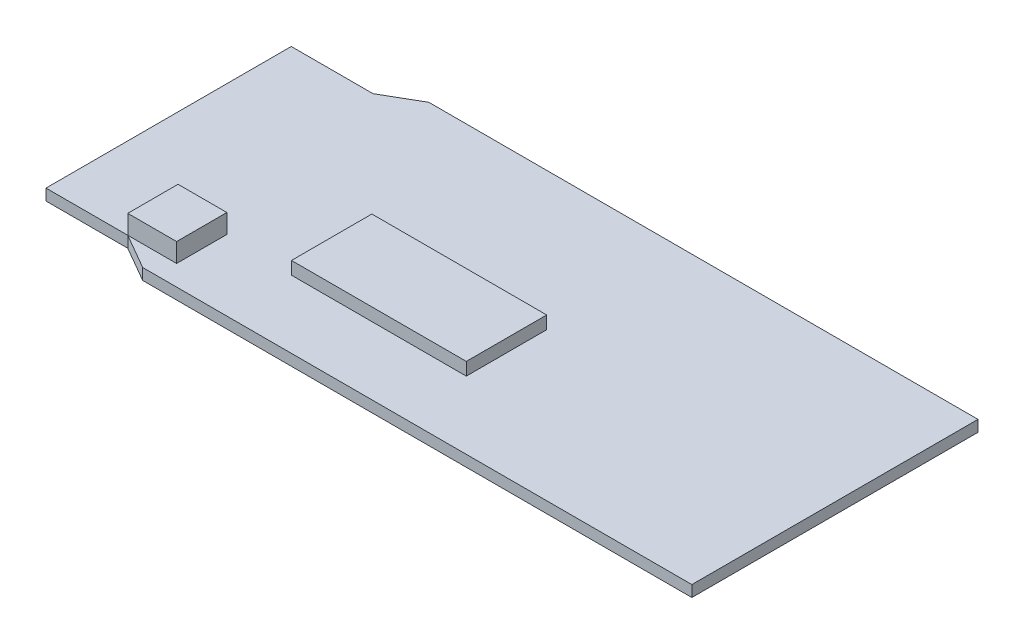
ISO-10303-21;
HEADER;
FILE_DESCRIPTION(('STEP AP214'),'2;1');
FILE_NAME('part.step','',(''),(''),'','','');
FILE_SCHEMA(('AUTOMOTIVE_DESIGN { 1 0 10303 214 1 1 1 1 }'));
ENDSEC;
DATA;
#1=APPLICATION_CONTEXT('core data for automotive mechanical design processes');
#2=APPLICATION_PROTOCOL_DEFINITION('international standard','automotive_design',2000,#1);
#3=PRODUCT_CONTEXT('',#1,'mechanical');
#4=PRODUCT('Part','Part','',(#3));
#5=PRODUCT_RELATED_PRODUCT_CATEGORY('part','',(#4));
#6=PRODUCT_DEFINITION_FORMATION('','',#4);
#7=PRODUCT_DEFINITION_CONTEXT('part definition',#1,'design');
#8=PRODUCT_DEFINITION('design','',#6,#7);
#9=PRODUCT_DEFINITION_SHAPE('','',#8);
#10=(LENGTH_UNIT() NAMED_UNIT(*) SI_UNIT(.MILLI.,.METRE.));
#11=(NAMED_UNIT(*) PLANE_ANGLE_UNIT() SI_UNIT($,.RADIAN.));
#12=(NAMED_UNIT(*) SI_UNIT($,.STERADIAN.) SOLID_ANGLE_UNIT());
#13=UNCERTAINTY_MEASURE_WITH_UNIT(LENGTH_MEASURE(1.E-05),#10,'distance_accuracy_value','');
#14=(GEOMETRIC_REPRESENTATION_CONTEXT(3) GLOBAL_UNCERTAINTY_ASSIGNED_CONTEXT((#13)) GLOBAL_UNIT_ASSIGNED_CONTEXT((#10,
#11,#12)) REPRESENTATION_CONTEXT('',''));
#15=CARTESIAN_POINT('',(0.,0.,0.));
#16=DIRECTION('',(0.,0.,1.));
#17=DIRECTION('',(1.,0.,0.));
#18=AXIS2_PLACEMENT_3D('',#15,#16,#17);
#19=CARTESIAN_POINT('',(-16.2364543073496,1.397,-17.78));
#20=DIRECTION('',(0.,-1.,0.));
#21=DIRECTION('',(0.,0.,-1.));
#22=AXIS2_PLACEMENT_3D('',#19,#20,#21);
#23=PLANE('',#22);
#24=DIRECTION('',(0.,0.,1.));
#25=VECTOR('',#24,1.);
#26=CARTESIAN_POINT('',(10.16,1.397,-2.54));
#27=LINE('',#26,#25);
#28=CARTESIAN_POINT('',(10.16,1.397,-8.7884));
#29=VERTEX_POINT('',#28);
#30=CARTESIAN_POINT('',(10.16,1.397,-2.54));
#31=VERTEX_POINT('',#30);
#32=EDGE_CURVE('E161',#29,#31,#27,.T.);
#33=ORIENTED_EDGE('',*,*,#32,.F.);
#34=DIRECTION('',(-1.,0.,0.));
#35=VECTOR('',#34,1.);
#36=CARTESIAN_POINT('',(10.16,1.397,-8.7884));
#37=LINE('',#36,#35);
#38=CARTESIAN_POINT('',(16.2306,1.397,-8.7884));
#39=VERTEX_POINT('',#38);
#40=EDGE_CURVE('E174',#39,#29,#37,.T.);
#41=ORIENTED_EDGE('',*,*,#40,.F.);
#42=DIRECTION('',(0.,0.,-1.));
#43=VECTOR('',#42,1.);
#44=CARTESIAN_POINT('',(16.2306,1.397,-2.54));
#45=LINE('',#44,#43);
#46=CARTESIAN_POINT('',(16.2306,1.397,-2.54));
#47=VERTEX_POINT('',#46);
#48=EDGE_CURVE('E183',#47,#39,#45,.T.);
#49=ORIENTED_EDGE('',*,*,#48,.F.);
#50=DIRECTION('',(1.,0.,0.));
#51=VECTOR('',#50,1.);
#52=CARTESIAN_POINT('',(10.16,1.397,-2.54));
#53=LINE('',#52,#51);
#54=EDGE_CURVE('E164',#31,#47,#53,.T.);
#55=ORIENTED_EDGE('',*,*,#54,.F.);
#56=DIRECTION('',(0.866025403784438,0.,0.500000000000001));
#57=VECTOR('',#56,1.);
#58=CARTESIAN_POINT('',(10.16,1.397,-2.54));
#59=LINE('',#58,#57);
#60=CARTESIAN_POINT('',(14.5594090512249,1.397,0.));
#61=VERTEX_POINT('',#60);
#62=EDGE_CURVE('E226',#31,#61,#59,.T.);
#63=ORIENTED_EDGE('',*,*,#62,.T.);
#64=DIRECTION('',(1.,0.,0.));
#65=VECTOR('',#64,1.);
#66=CARTESIAN_POINT('',(14.5594090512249,1.397,0.));
#67=LINE('',#66,#65);
#68=CARTESIAN_POINT('',(82.804,1.397,0.));
#69=VERTEX_POINT('',#68);
#70=EDGE_CURVE('E228',#61,#69,#67,.T.);
#71=ORIENTED_EDGE('',*,*,#70,.T.);
#72=DIRECTION('',(0.,0.,-1.));
#73=VECTOR('',#72,1.);
#74=CARTESIAN_POINT('',(82.804,1.397,0.));
#75=LINE('',#74,#73);
#76=CARTESIAN_POINT('',(82.804,1.397,-35.56));
#77=VERTEX_POINT('',#76);
#78=EDGE_CURVE('E230',#69,#77,#75,.T.);
#79=ORIENTED_EDGE('',*,*,#78,.T.);
#80=DIRECTION('',(-1.,0.,0.));
#81=VECTOR('',#80,1.);
#82=CARTESIAN_POINT('',(14.5594090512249,1.397,-35.56));
#83=LINE('',#82,#81);
#84=CARTESIAN_POINT('',(14.5594090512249,1.397,-35.56));
#85=VERTEX_POINT('',#84);
#86=EDGE_CURVE('E232',#77,#85,#83,.T.);
#87=ORIENTED_EDGE('',*,*,#86,.T.);
#88=DIRECTION('',(-0.866025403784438,0.,0.500000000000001));
#89=VECTOR('',#88,1.);
#90=CARTESIAN_POINT('',(10.16,1.397,-33.02));
#91=LINE('',#90,#89);
#92=CARTESIAN_POINT('',(10.16,1.397,-33.02));
#93=VERTEX_POINT('',#92);
#94=EDGE_CURVE('E216',#85,#93,#91,.T.);
#95=ORIENTED_EDGE('',*,*,#94,.T.);
#96=DIRECTION('',(-1.,0.,0.));
#97=VECTOR('',#96,1.);
#98=CARTESIAN_POINT('',(10.16,1.397,-33.02));
#99=LINE('',#98,#97);
#100=CARTESIAN_POINT('',(0.,1.397,-33.02));
#101=VERTEX_POINT('',#100);
#102=EDGE_CURVE('E219',#93,#101,#99,.T.);
#103=ORIENTED_EDGE('',*,*,#102,.T.);
#104=DIRECTION('',(0.,0.,1.));
#105=VECTOR('',#104,1.);
#106=CARTESIAN_POINT('',(0.,1.397,-2.54));
#107=LINE('',#106,#105);
#108=CARTESIAN_POINT('',(0.,1.397,-2.54));
#109=VERTEX_POINT('',#108);
#110=EDGE_CURVE('E221',#101,#109,#107,.T.);
#111=ORIENTED_EDGE('',*,*,#110,.T.);
#112=DIRECTION('',(1.,0.,0.));
#113=VECTOR('',#112,1.);
#114=CARTESIAN_POINT('',(10.16,1.397,-2.54));
#115=LINE('',#114,#113);
#116=EDGE_CURVE('E223',#109,#31,#115,.T.);
#117=ORIENTED_EDGE('',*,*,#116,.T.);
#118=EDGE_LOOP('',(#33,#41,#49,#55,#63,#71,#79,#87,#95,#103,#111,#117));
#119=FACE_BOUND('',#118,.T.);
#120=DIRECTION('',(0.,0.,1.));
#121=VECTOR('',#120,1.);
#122=CARTESIAN_POINT('',(24.6286693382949,1.397,-18.4085686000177));
#123=LINE('',#122,#121);
#124=CARTESIAN_POINT('',(24.6286693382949,1.397,-18.4085686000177));
#125=VERTEX_POINT('',#124);
#126=CARTESIAN_POINT('',(24.6286693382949,1.397,-8.41579483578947));
#127=VERTEX_POINT('',#126);
#128=EDGE_CURVE('E160',#125,#127,#123,.T.);
#129=ORIENTED_EDGE('',*,*,#128,.F.);
#130=DIRECTION('',(-1.,0.,0.));
#131=VECTOR('',#130,1.);
#132=CARTESIAN_POINT('',(24.6286693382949,1.397,-18.4085686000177));
#133=LINE('',#132,#131);
#134=CARTESIAN_POINT('',(46.3557815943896,1.397,-18.4085686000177));
#135=VERTEX_POINT('',#134);
#136=EDGE_CURVE('E157',#135,#125,#133,.T.);
#137=ORIENTED_EDGE('',*,*,#136,.F.);
#138=DIRECTION('',(0.,0.,-1.));
#139=VECTOR('',#138,1.);
#140=CARTESIAN_POINT('',(46.3557815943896,1.397,-18.4085686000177));
#141=LINE('',#140,#139);
#142=CARTESIAN_POINT('',(46.3557815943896,1.397,-8.41579483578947));
#143=VERTEX_POINT('',#142);
#144=EDGE_CURVE('E50',#143,#135,#141,.T.);
#145=ORIENTED_EDGE('',*,*,#144,.F.);
#146=DIRECTION('',(1.,0.,0.));
#147=VECTOR('',#146,1.);
#148=CARTESIAN_POINT('',(24.6286693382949,1.397,-8.41579483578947));
#149=LINE('',#148,#147);
#150=EDGE_CURVE('E45',#127,#143,#149,.T.);
#151=ORIENTED_EDGE('',*,*,#150,.F.);
#152=EDGE_LOOP('',(#129,#137,#145,#151));
#153=FACE_BOUND('',#152,.T.);
#154=ADVANCED_FACE('F30',(#119,#153),#23,.F.);
#155=CARTESIAN_POINT('',(10.16,1.397,-33.02));
#156=DIRECTION('',(0.500000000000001,0.,0.866025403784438));
#157=DIRECTION('',(0.866025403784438,0.,-0.500000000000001));
#158=AXIS2_PLACEMENT_3D('',#155,#156,#157);
#159=PLANE('',#158);
#160=DIRECTION('',(-0.866025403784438,0.,0.500000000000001));
#161=VECTOR('',#160,1.);
#162=CARTESIAN_POINT('',(10.16,0.,-33.02));
#163=LINE('',#162,#161);
#164=CARTESIAN_POINT('',(14.5594090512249,0.,-35.56));
#165=VERTEX_POINT('',#164);
#166=CARTESIAN_POINT('',(10.16,0.,-33.02));
#167=VERTEX_POINT('',#166);
#168=EDGE_CURVE('E199',#165,#167,#163,.T.);
#169=ORIENTED_EDGE('',*,*,#168,.T.);
#170=DIRECTION('',(0.,-1.,0.));
#171=VECTOR('',#170,1.);
#172=CARTESIAN_POINT('',(10.16,1.397,-33.02));
#173=LINE('',#172,#171);
#174=EDGE_CURVE('E11',#93,#167,#173,.T.);
#175=ORIENTED_EDGE('',*,*,#174,.F.);
#176=ORIENTED_EDGE('',*,*,#94,.F.);
#177=DIRECTION('',(0.,-1.,0.));
#178=VECTOR('',#177,1.);
#179=CARTESIAN_POINT('',(14.5594090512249,1.397,-35.56));
#180=LINE('',#179,#178);
#181=EDGE_CURVE('E234',#85,#165,#180,.T.);
#182=ORIENTED_EDGE('',*,*,#181,.T.);
#183=EDGE_LOOP('',(#169,#175,#176,#182));
#184=FACE_BOUND('',#183,.T.);
#185=ADVANCED_FACE('F32',(#184),#159,.F.);
#186=CARTESIAN_POINT('',(10.16,1.397,-33.02));
#187=DIRECTION('',(0.,0.,1.));
#188=DIRECTION('',(1.,0.,0.));
#189=AXIS2_PLACEMENT_3D('',#186,#187,#188);
#190=PLANE('',#189);
#191=DIRECTION('',(-1.,0.,0.));
#192=VECTOR('',#191,1.);
#193=CARTESIAN_POINT('',(10.16,0.,-33.02));
#194=LINE('',#193,#192);
#195=CARTESIAN_POINT('',(0.,0.,-33.02));
#196=VERTEX_POINT('',#195);
#197=EDGE_CURVE('E202',#167,#196,#194,.T.);
#198=ORIENTED_EDGE('',*,*,#197,.T.);
#199=DIRECTION('',(0.,-1.,0.));
#200=VECTOR('',#199,1.);
#201=CARTESIAN_POINT('',(0.,1.397,-33.02));
#202=LINE('',#201,#200);
#203=EDGE_CURVE('E38',#101,#196,#202,.T.);
#204=ORIENTED_EDGE('',*,*,#203,.F.);
#205=ORIENTED_EDGE('',*,*,#102,.F.);
#206=ORIENTED_EDGE('',*,*,#174,.T.);
#207=EDGE_LOOP('',(#198,#204,#205,#206));
#208=FACE_BOUND('',#207,.T.);
#209=ADVANCED_FACE('F305',(#208),#190,.F.);
#210=CARTESIAN_POINT('',(0.,1.397,-2.54));
#211=DIRECTION('',(1.,0.,0.));
#212=DIRECTION('',(0.,0.,-1.));
#213=AXIS2_PLACEMENT_3D('',#210,#211,#212);
#214=PLANE('',#213);
#215=DIRECTION('',(0.,0.,1.));
#216=VECTOR('',#215,1.);
#217=CARTESIAN_POINT('',(0.,0.,-2.54));
#218=LINE('',#217,#216);
#219=CARTESIAN_POINT('',(0.,0.,-2.54));
#220=VERTEX_POINT('',#219);
#221=EDGE_CURVE('E204',#196,#220,#218,.T.);
#222=ORIENTED_EDGE('',*,*,#221,.T.);
#223=DIRECTION('',(0.,-1.,0.));
#224=VECTOR('',#223,1.);
#225=CARTESIAN_POINT('',(0.,1.397,-2.54));
#226=LINE('',#225,#224);
#227=EDGE_CURVE('E249',#109,#220,#226,.T.);
#228=ORIENTED_EDGE('',*,*,#227,.F.);
#229=ORIENTED_EDGE('',*,*,#110,.F.);
#230=ORIENTED_EDGE('',*,*,#203,.T.);
#231=EDGE_LOOP('',(#222,#228,#229,#230));
#232=FACE_BOUND('',#231,.T.);
#233=ADVANCED_FACE('F256',(#232),#214,.F.);
#234=CARTESIAN_POINT('',(10.16,1.397,-2.54));
#235=DIRECTION('',(0.,0.,-1.));
#236=DIRECTION('',(-1.,0.,0.));
#237=AXIS2_PLACEMENT_3D('',#234,#235,#236);
#238=PLANE('',#237);
#239=DIRECTION('',(1.,0.,0.));
#240=VECTOR('',#239,1.);
#241=CARTESIAN_POINT('',(10.16,0.,-2.54));
#242=LINE('',#241,#240);
#243=CARTESIAN_POINT('',(10.16,0.,-2.54));
#244=VERTEX_POINT('',#243);
#245=EDGE_CURVE('E206',#220,#244,#242,.T.);
#246=ORIENTED_EDGE('',*,*,#245,.T.);
#247=DIRECTION('',(0.,-1.,0.));
#248=VECTOR('',#247,1.);
#249=CARTESIAN_POINT('',(10.16,1.397,-2.54));
#250=LINE('',#249,#248);
#251=EDGE_CURVE('E246',#31,#244,#250,.T.);
#252=ORIENTED_EDGE('',*,*,#251,.F.);
#253=ORIENTED_EDGE('',*,*,#116,.F.);
#254=ORIENTED_EDGE('',*,*,#227,.T.);
#255=EDGE_LOOP('',(#246,#252,#253,#254));
#256=FACE_BOUND('',#255,.T.);
#257=ADVANCED_FACE('F267',(#256),#238,.F.);
#258=CARTESIAN_POINT('',(10.16,1.397,-2.54));
#259=DIRECTION('',(0.500000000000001,0.,-0.866025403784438));
#260=DIRECTION('',(-0.866025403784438,0.,-0.500000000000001));
#261=AXIS2_PLACEMENT_3D('',#258,#259,#260);
#262=PLANE('',#261);
#263=DIRECTION('',(0.866025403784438,0.,0.500000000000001));
#264=VECTOR('',#263,1.);
#265=CARTESIAN_POINT('',(10.16,0.,-2.54));
#266=LINE('',#265,#264);
#267=CARTESIAN_POINT('',(14.5594090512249,0.,0.));
#268=VERTEX_POINT('',#267);
#269=EDGE_CURVE('E208',#244,#268,#266,.T.);
#270=ORIENTED_EDGE('',*,*,#269,.T.);
#271=DIRECTION('',(0.,-1.,0.));
#272=VECTOR('',#271,1.);
#273=CARTESIAN_POINT('',(14.5594090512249,1.397,0.));
#274=LINE('',#273,#272);
#275=EDGE_CURVE('E243',#61,#268,#274,.T.);
#276=ORIENTED_EDGE('',*,*,#275,.F.);
#277=ORIENTED_EDGE('',*,*,#62,.F.);
#278=ORIENTED_EDGE('',*,*,#251,.T.);
#279=EDGE_LOOP('',(#270,#276,#277,#278));
#280=FACE_BOUND('',#279,.T.);
#281=ADVANCED_FACE('F271',(#280),#262,.F.);
#282=CARTESIAN_POINT('',(14.5594090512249,1.397,0.));
#283=DIRECTION('',(0.,0.,-1.));
#284=DIRECTION('',(-1.,0.,0.));
#285=AXIS2_PLACEMENT_3D('',#282,#283,#284);
#286=PLANE('',#285);
#287=DIRECTION('',(1.,0.,0.));
#288=VECTOR('',#287,1.);
#289=CARTESIAN_POINT('',(14.5594090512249,0.,0.));
#290=LINE('',#289,#288);
#291=CARTESIAN_POINT('',(82.804,0.,0.));
#292=VERTEX_POINT('',#291);
#293=EDGE_CURVE('E210',#268,#292,#290,.T.);
#294=ORIENTED_EDGE('',*,*,#293,.T.);
#295=DIRECTION('',(0.,-1.,0.));
#296=VECTOR('',#295,1.);
#297=CARTESIAN_POINT('',(82.804,1.397,0.));
#298=LINE('',#297,#296);
#299=EDGE_CURVE('E240',#69,#292,#298,.T.);
#300=ORIENTED_EDGE('',*,*,#299,.F.);
#301=ORIENTED_EDGE('',*,*,#70,.F.);
#302=ORIENTED_EDGE('',*,*,#275,.T.);
#303=EDGE_LOOP('',(#294,#300,#301,#302));
#304=FACE_BOUND('',#303,.T.);
#305=ADVANCED_FACE('F317',(#304),#286,.F.);
#306=CARTESIAN_POINT('',(82.804,1.397,0.));
#307=DIRECTION('',(-1.,0.,0.));
#308=DIRECTION('',(0.,0.,1.));
#309=AXIS2_PLACEMENT_3D('',#306,#307,#308);
#310=PLANE('',#309);
#311=DIRECTION('',(0.,0.,-1.));
#312=VECTOR('',#311,1.);
#313=CARTESIAN_POINT('',(82.804,0.,0.));
#314=LINE('',#313,#312);
#315=CARTESIAN_POINT('',(82.804,0.,-35.56));
#316=VERTEX_POINT('',#315);
#317=EDGE_CURVE('E212',#292,#316,#314,.T.);
#318=ORIENTED_EDGE('',*,*,#317,.T.);
#319=DIRECTION('',(0.,-1.,0.));
#320=VECTOR('',#319,1.);
#321=CARTESIAN_POINT('',(82.804,1.397,-35.56));
#322=LINE('',#321,#320);
#323=EDGE_CURVE('E237',#77,#316,#322,.T.);
#324=ORIENTED_EDGE('',*,*,#323,.F.);
#325=ORIENTED_EDGE('',*,*,#78,.F.);
#326=ORIENTED_EDGE('',*,*,#299,.T.);
#327=EDGE_LOOP('',(#318,#324,#325,#326));
#328=FACE_BOUND('',#327,.T.);
#329=ADVANCED_FACE('F313',(#328),#310,.F.);
#330=CARTESIAN_POINT('',(14.5594090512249,1.397,-35.56));
#331=DIRECTION('',(0.,0.,1.));
#332=DIRECTION('',(1.,0.,0.));
#333=AXIS2_PLACEMENT_3D('',#330,#331,#332);
#334=PLANE('',#333);
#335=DIRECTION('',(-1.,0.,0.));
#336=VECTOR('',#335,1.);
#337=CARTESIAN_POINT('',(14.5594090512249,0.,-35.56));
#338=LINE('',#337,#336);
#339=EDGE_CURVE('E214',#316,#165,#338,.T.);
#340=ORIENTED_EDGE('',*,*,#339,.T.);
#341=ORIENTED_EDGE('',*,*,#181,.F.);
#342=ORIENTED_EDGE('',*,*,#86,.F.);
#343=ORIENTED_EDGE('',*,*,#323,.T.);
#344=EDGE_LOOP('',(#340,#341,#342,#343));
#345=FACE_BOUND('',#344,.T.);
#346=ADVANCED_FACE('F310',(#345),#334,.F.);
#347=CARTESIAN_POINT('',(-16.2364543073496,0.,-17.78));
#348=DIRECTION('',(0.,-1.,0.));
#349=DIRECTION('',(0.,0.,-1.));
#350=AXIS2_PLACEMENT_3D('',#347,#348,#349);
#351=PLANE('',#350);
#352=ORIENTED_EDGE('',*,*,#168,.F.);
#353=ORIENTED_EDGE('',*,*,#339,.F.);
#354=ORIENTED_EDGE('',*,*,#317,.F.);
#355=ORIENTED_EDGE('',*,*,#293,.F.);
#356=ORIENTED_EDGE('',*,*,#269,.F.);
#357=ORIENTED_EDGE('',*,*,#245,.F.);
#358=ORIENTED_EDGE('',*,*,#221,.F.);
#359=ORIENTED_EDGE('',*,*,#197,.F.);
#360=EDGE_LOOP('',(#352,#353,#354,#355,#356,#357,#358,#359));
#361=FACE_BOUND('',#360,.T.);
#362=ADVANCED_FACE('F262',(#361),#351,.T.);
#363=CARTESIAN_POINT('',(10.16,3.7592,-2.54));
#364=DIRECTION('',(1.,0.,0.));
#365=DIRECTION('',(0.,0.,-1.));
#366=AXIS2_PLACEMENT_3D('',#363,#364,#365);
#367=PLANE('',#366);
#368=ORIENTED_EDGE('',*,*,#32,.T.);
#369=DIRECTION('',(0.,-1.,0.));
#370=VECTOR('',#369,1.);
#371=CARTESIAN_POINT('',(10.16,3.7592,-2.54));
#372=LINE('',#371,#370);
#373=CARTESIAN_POINT('',(10.16,3.7592,-2.54));
#374=VERTEX_POINT('',#373);
#375=EDGE_CURVE('E196',#374,#31,#372,.T.);
#376=ORIENTED_EDGE('',*,*,#375,.F.);
#377=DIRECTION('',(0.,0.,1.));
#378=VECTOR('',#377,1.);
#379=CARTESIAN_POINT('',(10.16,3.7592,-2.54));
#380=LINE('',#379,#378);
#381=CARTESIAN_POINT('',(10.16,3.7592,-8.7884));
#382=VERTEX_POINT('',#381);
#383=EDGE_CURVE('E170',#382,#374,#380,.T.);
#384=ORIENTED_EDGE('',*,*,#383,.F.);
#385=DIRECTION('',(0.,-1.,0.));
#386=VECTOR('',#385,1.);
#387=CARTESIAN_POINT('',(10.16,3.7592,-8.7884));
#388=LINE('',#387,#386);
#389=EDGE_CURVE('E179',#382,#29,#388,.T.);
#390=ORIENTED_EDGE('',*,*,#389,.T.);
#391=EDGE_LOOP('',(#368,#376,#384,#390));
#392=FACE_BOUND('',#391,.T.);
#393=ADVANCED_FACE('F281',(#392),#367,.F.);
#394=CARTESIAN_POINT('',(10.16,3.7592,-2.54));
#395=DIRECTION('',(0.,0.,-1.));
#396=DIRECTION('',(-1.,0.,0.));
#397=AXIS2_PLACEMENT_3D('',#394,#395,#396);
#398=PLANE('',#397);
#399=ORIENTED_EDGE('',*,*,#54,.T.);
#400=DIRECTION('',(0.,-1.,0.));
#401=VECTOR('',#400,1.);
#402=CARTESIAN_POINT('',(16.2306,3.7592,-2.54));
#403=LINE('',#402,#401);
#404=CARTESIAN_POINT('',(16.2306,3.7592,-2.54));
#405=VERTEX_POINT('',#404);
#406=EDGE_CURVE('E193',#405,#47,#403,.T.);
#407=ORIENTED_EDGE('',*,*,#406,.F.);
#408=DIRECTION('',(1.,0.,0.));
#409=VECTOR('',#408,1.);
#410=CARTESIAN_POINT('',(10.16,3.7592,-2.54));
#411=LINE('',#410,#409);
#412=EDGE_CURVE('E173',#374,#405,#411,.T.);
#413=ORIENTED_EDGE('',*,*,#412,.F.);
#414=ORIENTED_EDGE('',*,*,#375,.T.);
#415=EDGE_LOOP('',(#399,#407,#413,#414));
#416=FACE_BOUND('',#415,.T.);
#417=ADVANCED_FACE('F277',(#416),#398,.F.);
#418=CARTESIAN_POINT('',(16.2306,3.7592,-2.54));
#419=DIRECTION('',(-1.,0.,0.));
#420=DIRECTION('',(0.,0.,1.));
#421=AXIS2_PLACEMENT_3D('',#418,#419,#420);
#422=PLANE('',#421);
#423=ORIENTED_EDGE('',*,*,#48,.T.);
#424=DIRECTION('',(0.,-1.,0.));
#425=VECTOR('',#424,1.);
#426=CARTESIAN_POINT('',(16.2306,3.7592,-8.7884));
#427=LINE('',#426,#425);
#428=CARTESIAN_POINT('',(16.2306,3.7592,-8.7884));
#429=VERTEX_POINT('',#428);
#430=EDGE_CURVE('E190',#429,#39,#427,.T.);
#431=ORIENTED_EDGE('',*,*,#430,.F.);
#432=DIRECTION('',(0.,0.,-1.));
#433=VECTOR('',#432,1.);
#434=CARTESIAN_POINT('',(16.2306,3.7592,-2.54));
#435=LINE('',#434,#433);
#436=EDGE_CURVE('E176',#405,#429,#435,.T.);
#437=ORIENTED_EDGE('',*,*,#436,.F.);
#438=ORIENTED_EDGE('',*,*,#406,.T.);
#439=EDGE_LOOP('',(#423,#431,#437,#438));
#440=FACE_BOUND('',#439,.T.);
#441=ADVANCED_FACE('F289',(#440),#422,.F.);
#442=CARTESIAN_POINT('',(10.16,3.7592,-8.7884));
#443=DIRECTION('',(0.,0.,1.));
#444=DIRECTION('',(1.,0.,0.));
#445=AXIS2_PLACEMENT_3D('',#442,#443,#444);
#446=PLANE('',#445);
#447=ORIENTED_EDGE('',*,*,#40,.T.);
#448=ORIENTED_EDGE('',*,*,#389,.F.);
#449=DIRECTION('',(-1.,0.,0.));
#450=VECTOR('',#449,1.);
#451=CARTESIAN_POINT('',(10.16,3.7592,-8.7884));
#452=LINE('',#451,#450);
#453=EDGE_CURVE('E178',#429,#382,#452,.T.);
#454=ORIENTED_EDGE('',*,*,#453,.F.);
#455=ORIENTED_EDGE('',*,*,#430,.T.);
#456=EDGE_LOOP('',(#447,#448,#454,#455));
#457=FACE_BOUND('',#456,.T.);
#458=ADVANCED_FACE('F284',(#457),#446,.F.);
#459=CARTESIAN_POINT('',(10.16,3.7592,-8.7884));
#460=DIRECTION('',(0.,-1.,0.));
#461=DIRECTION('',(0.,0.,-1.));
#462=AXIS2_PLACEMENT_3D('',#459,#460,#461);
#463=PLANE('',#462);
#464=ORIENTED_EDGE('',*,*,#383,.T.);
#465=ORIENTED_EDGE('',*,*,#412,.T.);
#466=ORIENTED_EDGE('',*,*,#436,.T.);
#467=ORIENTED_EDGE('',*,*,#453,.T.);
#468=EDGE_LOOP('',(#464,#465,#466,#467));
#469=FACE_BOUND('',#468,.T.);
#470=ADVANCED_FACE('F291',(#469),#463,.F.);
#471=CARTESIAN_POINT('',(24.6286693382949,2.9845,-18.4085686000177));
#472=DIRECTION('',(1.,0.,0.));
#473=DIRECTION('',(0.,0.,-1.));
#474=AXIS2_PLACEMENT_3D('',#471,#472,#473);
#475=PLANE('',#474);
#476=ORIENTED_EDGE('',*,*,#128,.T.);
#477=DIRECTION('',(0.,-1.,0.));
#478=VECTOR('',#477,1.);
#479=CARTESIAN_POINT('',(24.6286693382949,2.9845,-8.41579483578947));
#480=LINE('',#479,#478);
#481=CARTESIAN_POINT('',(24.6286693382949,2.9845,-8.41579483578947));
#482=VERTEX_POINT('',#481);
#483=EDGE_CURVE('E141',#482,#127,#480,.T.);
#484=ORIENTED_EDGE('',*,*,#483,.F.);
#485=DIRECTION('',(0.,0.,1.));
#486=VECTOR('',#485,1.);
#487=CARTESIAN_POINT('',(24.6286693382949,2.9845,-18.4085686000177));
#488=LINE('',#487,#486);
#489=CARTESIAN_POINT('',(24.6286693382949,2.9845,-18.4085686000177));
#490=VERTEX_POINT('',#489);
#491=EDGE_CURVE('E148',#490,#482,#488,.T.);
#492=ORIENTED_EDGE('',*,*,#491,.F.);
#493=DIRECTION('',(0.,-1.,0.));
#494=VECTOR('',#493,1.);
#495=CARTESIAN_POINT('',(24.6286693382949,2.9845,-18.4085686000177));
#496=LINE('',#495,#494);
#497=EDGE_CURVE('E447',#490,#125,#496,.T.);
#498=ORIENTED_EDGE('',*,*,#497,.T.);
#499=EDGE_LOOP('',(#476,#484,#492,#498));
#500=FACE_BOUND('',#499,.T.);
#501=ADVANCED_FACE('F159',(#500),#475,.F.);
#502=CARTESIAN_POINT('',(24.6286693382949,2.9845,-8.41579483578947));
#503=DIRECTION('',(0.,0.,-1.));
#504=DIRECTION('',(-1.,0.,0.));
#505=AXIS2_PLACEMENT_3D('',#502,#503,#504);
#506=PLANE('',#505);
#507=ORIENTED_EDGE('',*,*,#150,.T.);
#508=DIRECTION('',(0.,-1.,0.));
#509=VECTOR('',#508,1.);
#510=CARTESIAN_POINT('',(46.3557815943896,2.9845,-8.41579483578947));
#511=LINE('',#510,#509);
#512=CARTESIAN_POINT('',(46.3557815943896,2.9845,-8.41579483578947));
#513=VERTEX_POINT('',#512);
#514=EDGE_CURVE('E144',#513,#143,#511,.T.);
#515=ORIENTED_EDGE('',*,*,#514,.F.);
#516=DIRECTION('',(1.,0.,0.));
#517=VECTOR('',#516,1.);
#518=CARTESIAN_POINT('',(24.6286693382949,2.9845,-8.41579483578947));
#519=LINE('',#518,#517);
#520=EDGE_CURVE('E137',#482,#513,#519,.T.);
#521=ORIENTED_EDGE('',*,*,#520,.F.);
#522=ORIENTED_EDGE('',*,*,#483,.T.);
#523=EDGE_LOOP('',(#507,#515,#521,#522));
#524=FACE_BOUND('',#523,.T.);
#525=ADVANCED_FACE('F139',(#524),#506,.F.);
#526=CARTESIAN_POINT('',(46.3557815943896,2.9845,-18.4085686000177));
#527=DIRECTION('',(-1.,0.,0.));
#528=DIRECTION('',(0.,0.,1.));
#529=AXIS2_PLACEMENT_3D('',#526,#527,#528);
#530=PLANE('',#529);
#531=ORIENTED_EDGE('',*,*,#144,.T.);
#532=DIRECTION('',(0.,-1.,0.));
#533=VECTOR('',#532,1.);
#534=CARTESIAN_POINT('',(46.3557815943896,2.9845,-18.4085686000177));
#535=LINE('',#534,#533);
#536=CARTESIAN_POINT('',(46.3557815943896,2.9845,-18.4085686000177));
#537=VERTEX_POINT('',#536);
#538=EDGE_CURVE('E166',#537,#135,#535,.T.);
#539=ORIENTED_EDGE('',*,*,#538,.F.);
#540=DIRECTION('',(0.,0.,-1.));
#541=VECTOR('',#540,1.);
#542=CARTESIAN_POINT('',(46.3557815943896,2.9845,-18.4085686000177));
#543=LINE('',#542,#541);
#544=EDGE_CURVE('E147',#513,#537,#543,.T.);
#545=ORIENTED_EDGE('',*,*,#544,.F.);
#546=ORIENTED_EDGE('',*,*,#514,.T.);
#547=EDGE_LOOP('',(#531,#539,#545,#546));
#548=FACE_BOUND('',#547,.T.);
#549=ADVANCED_FACE('F414',(#548),#530,.F.);
#550=CARTESIAN_POINT('',(24.6286693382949,2.9845,-18.4085686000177));
#551=DIRECTION('',(0.,0.,1.));
#552=DIRECTION('',(1.,0.,0.));
#553=AXIS2_PLACEMENT_3D('',#550,#551,#552);
#554=PLANE('',#553);
#555=ORIENTED_EDGE('',*,*,#136,.T.);
#556=ORIENTED_EDGE('',*,*,#497,.F.);
#557=DIRECTION('',(-1.,0.,0.));
#558=VECTOR('',#557,1.);
#559=CARTESIAN_POINT('',(24.6286693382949,2.9845,-18.4085686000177));
#560=LINE('',#559,#558);
#561=EDGE_CURVE('E153',#537,#490,#560,.T.);
#562=ORIENTED_EDGE('',*,*,#561,.F.);
#563=ORIENTED_EDGE('',*,*,#538,.T.);
#564=EDGE_LOOP('',(#555,#556,#562,#563));
#565=FACE_BOUND('',#564,.T.);
#566=ADVANCED_FACE('F423',(#565),#554,.F.);
#567=CARTESIAN_POINT('',(24.6286693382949,2.9845,-8.41579483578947));
#568=DIRECTION('',(0.,1.,0.));
#569=DIRECTION('',(0.,0.,1.));
#570=AXIS2_PLACEMENT_3D('',#567,#568,#569);
#571=PLANE('',#570);
#572=ORIENTED_EDGE('',*,*,#491,.T.);
#573=ORIENTED_EDGE('',*,*,#520,.T.);
#574=ORIENTED_EDGE('',*,*,#544,.T.);
#575=ORIENTED_EDGE('',*,*,#561,.T.);
#576=EDGE_LOOP('',(#572,#573,#574,#575));
#577=FACE_BOUND('',#576,.T.);
#578=ADVANCED_FACE('F151',(#577),#571,.T.);
#579=CLOSED_SHELL('',(#154,#185,#209,#233,#257,#281,#305,#329,#346,#362,#393,#417,#441,#458,
#470,#501,#525,#549,#566,#578));
#580=MANIFOLD_SOLID_BREP('B2',#579);
#581=ADVANCED_BREP_SHAPE_REPRESENTATION('',(#18,#580),#14);
#582=SHAPE_DEFINITION_REPRESENTATION(#9,#581);
ENDSEC;
END-ISO-10303-21;
